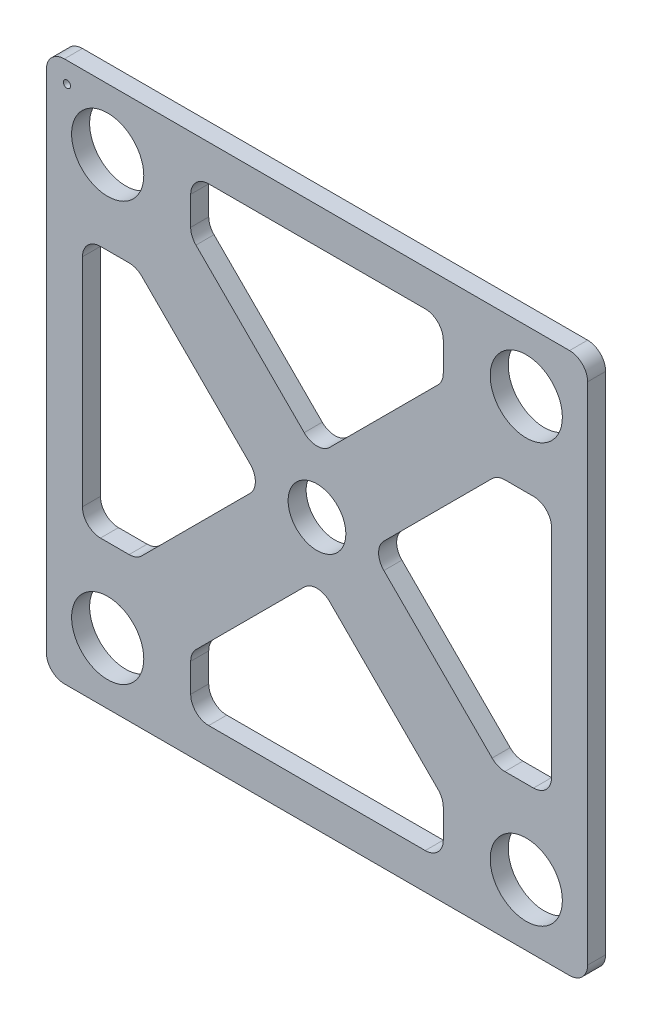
from build123d import *

# Parameters (mm, degrees)
ESQUISSE1_R        = 10
ESQUISSE1_R_2      = 8
ESQUISSE1_R_3      = 1
BOSS_EXTRU_1_DEPTH = 5


with BuildPart() as part:
    # Esquisse1 → Boss.-Extru.1 (new body)
    with BuildSketch(Plane.XY):
        with BuildLine():
            Line((-70, -75), (70, -75))
            ThreePointArc((70, -75), (73.535533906, -73.535533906), (75, -70))
            Line((75, -70), (75, 70))
            ThreePointArc((75, 70), (73.535533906, 73.535533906), (70, 75))
            Line((70, 75), (-70, 75))
            ThreePointArc((-70, 75), (-73.535533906, 73.535533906), (-75, 70))
            Line((-75, 70), (-75, -70))
            ThreePointArc((-75, -70), (-73.535533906, -73.535533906), (-70, -75))
        make_face()
        with Locations((-58, 58)):
            Circle(ESQUISSE1_R, mode=Mode.SUBTRACT)
        with Locations((58, 58)):
            Circle(ESQUISSE1_R, mode=Mode.SUBTRACT)
        with Locations((58, -58)):
            Circle(ESQUISSE1_R, mode=Mode.SUBTRACT)
        with Locations((-58, -58)):
            Circle(ESQUISSE1_R, mode=Mode.SUBTRACT)
        Circle(ESQUISSE1_R_2, mode=Mode.SUBTRACT)
        with Locations((-69.296464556, 69.296464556)):
            Circle(ESQUISSE1_R_3, mode=Mode.SUBTRACT)
        with BuildLine():
            Line((-30, 65), (30, 65))
            ThreePointArc((30, 65), (33.535533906, 63.535533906), (35, 60))
            Line((35, 60), (35, 52.071067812))
            ThreePointArc((35, 52.071067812), (34.619397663, 50.15765065), (33.535533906, 48.535533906))
            Line((33.535533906, 48.535533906), (3.535533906, 18.535533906))
            ThreePointArc((3.535533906, 18.535533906), (0, 17.071067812), (-3.535533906, 18.535533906))
            Line((-3.535533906, 18.535533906), (-33.535533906, 48.535533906))
            ThreePointArc((-33.535533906, 48.535533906), (-34.619397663, 50.15765065), (-35, 52.071067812))
            Line((-35, 52.071067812), (-35, 60))
            ThreePointArc((-35, 60), (-33.535533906, 63.535533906), (-30, 65))
        make_face(mode=Mode.SUBTRACT)
        with BuildLine():
            Line((-48.535533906, 33.535533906), (-18.535533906, 3.535533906))
            ThreePointArc((-18.535533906, 3.535533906), (-17.071067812, 0), (-18.535533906, -3.535533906))
            Line((-18.535533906, -3.535533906), (-48.535533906, -33.535533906))
            ThreePointArc((-48.535533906, -33.535533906), (-50.15765065, -34.619397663), (-52.071067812, -35))
            Line((-52.071067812, -35), (-60, -35))
            ThreePointArc((-60, -35), (-63.535533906, -33.535533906), (-65, -30))
            Line((-65, -30), (-65, 30))
            ThreePointArc((-65, 30), (-63.535533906, 33.535533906), (-60, 35))
            Line((-60, 35), (-52.071067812, 35))
            ThreePointArc((-52.071067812, 35), (-50.15765065, 34.619397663), (-48.535533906, 33.535533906))
        make_face(mode=Mode.SUBTRACT)
        with BuildLine():
            Line((48.535533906, 33.535533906), (18.535533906, 3.535533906))
            ThreePointArc((18.535533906, 3.535533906), (17.071067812, 0), (18.535533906, -3.535533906))
            Line((18.535533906, -3.535533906), (48.535533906, -33.535533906))
            ThreePointArc((48.535533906, -33.535533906), (50.15765065, -34.619397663), (52.071067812, -35))
            Line((52.071067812, -35), (60, -35))
            ThreePointArc((60, -35), (63.535533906, -33.535533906), (65, -30))
            Line((65, -30), (65, 30))
            ThreePointArc((65, 30), (63.535533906, 33.535533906), (60, 35))
            Line((60, 35), (52.071067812, 35))
            ThreePointArc((52.071067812, 35), (50.15765065, 34.619397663), (48.535533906, 33.535533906))
        make_face(mode=Mode.SUBTRACT)
        with BuildLine():
            Line((33.535533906, -48.535533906), (3.535533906, -18.535533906))
            ThreePointArc((3.535533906, -18.535533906), (0, -17.071067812), (-3.535533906, -18.535533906))
            Line((-3.535533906, -18.535533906), (-33.535533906, -48.535533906))
            ThreePointArc((-33.535533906, -48.535533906), (-34.619397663, -50.15765065), (-35, -52.071067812))
            Line((-35, -52.071067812), (-35, -60))
            ThreePointArc((-35, -60), (-33.535533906, -63.535533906), (-30, -65))
            Line((-30, -65), (30, -65))
            ThreePointArc((30, -65), (33.535533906, -63.535533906), (35, -60))
            Line((35, -60), (35, -52.071067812))
            ThreePointArc((35, -52.071067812), (34.619397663, -50.15765065), (33.535533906, -48.535533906))
        make_face(mode=Mode.SUBTRACT)
    extrude(amount=BOSS_EXTRU_1_DEPTH)


solid = part.part
